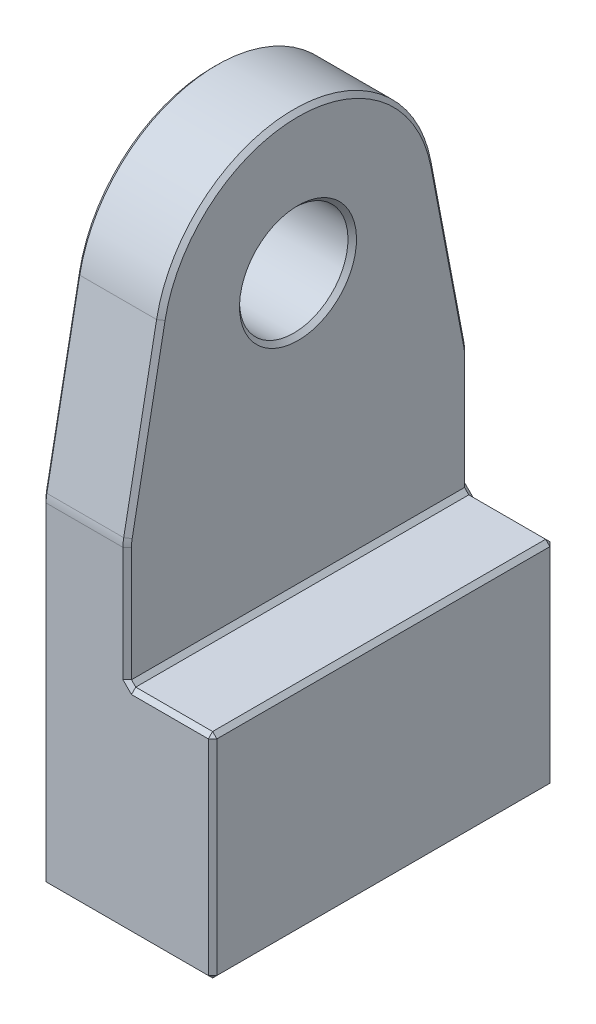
ISO-10303-21;
HEADER;
FILE_DESCRIPTION(('STEP AP214'),'2;1');
FILE_NAME('part.step','',(''),(''),'','','');
FILE_SCHEMA(('AUTOMOTIVE_DESIGN { 1 0 10303 214 1 1 1 1 }'));
ENDSEC;
DATA;
#1=APPLICATION_CONTEXT('core data for automotive mechanical design processes');
#2=APPLICATION_PROTOCOL_DEFINITION('international standard','automotive_design',2000,#1);
#3=PRODUCT_CONTEXT('',#1,'mechanical');
#4=PRODUCT('Part','Part','',(#3));
#5=PRODUCT_RELATED_PRODUCT_CATEGORY('part','',(#4));
#6=PRODUCT_DEFINITION_FORMATION('','',#4);
#7=PRODUCT_DEFINITION_CONTEXT('part definition',#1,'design');
#8=PRODUCT_DEFINITION('design','',#6,#7);
#9=PRODUCT_DEFINITION_SHAPE('','',#8);
#10=(LENGTH_UNIT() NAMED_UNIT(*) SI_UNIT(.MILLI.,.METRE.));
#11=(NAMED_UNIT(*) PLANE_ANGLE_UNIT() SI_UNIT($,.RADIAN.));
#12=(NAMED_UNIT(*) SI_UNIT($,.STERADIAN.) SOLID_ANGLE_UNIT());
#13=UNCERTAINTY_MEASURE_WITH_UNIT(LENGTH_MEASURE(1.E-05),#10,'distance_accuracy_value','');
#14=(GEOMETRIC_REPRESENTATION_CONTEXT(3) GLOBAL_UNCERTAINTY_ASSIGNED_CONTEXT((#13)) GLOBAL_UNIT_ASSIGNED_CONTEXT((#10,
#11,#12)) REPRESENTATION_CONTEXT('',''));
#15=CARTESIAN_POINT('',(0.,0.,0.));
#16=DIRECTION('',(0.,0.,1.));
#17=DIRECTION('',(1.,0.,0.));
#18=AXIS2_PLACEMENT_3D('',#15,#16,#17);
#19=CARTESIAN_POINT('',(20.,-18.0723794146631,-20.));
#20=DIRECTION('',(0.,0.,1.));
#21=DIRECTION('',(0.,-1.,0.));
#22=AXIS2_PLACEMENT_3D('',#19,#20,#21);
#23=PLANE('',#22);
#24=DIRECTION('',(-1.,0.,0.));
#25=VECTOR('',#24,1.);
#26=CARTESIAN_POINT('',(20.,-18.0723794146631,-20.));
#27=LINE('',#26,#25);
#28=CARTESIAN_POINT('',(9.50000000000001,-18.0723794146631,-20.));
#29=VERTEX_POINT('',#28);
#30=CARTESIAN_POINT('',(0.500000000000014,-18.0723794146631,-20.));
#31=VERTEX_POINT('',#30);
#32=EDGE_CURVE('E404',#29,#31,#27,.T.);
#33=ORIENTED_EDGE('',*,*,#32,.F.);
#34=DIRECTION('',(0.,-1.,0.));
#35=VECTOR('',#34,1.);
#36=CARTESIAN_POINT('',(9.50000000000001,-18.0723794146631,-20.));
#37=LINE('',#36,#35);
#38=CARTESIAN_POINT('',(9.50000000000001,-31.5,-20.));
#39=VERTEX_POINT('',#38);
#40=EDGE_CURVE('E248',#29,#39,#37,.T.);
#41=ORIENTED_EDGE('',*,*,#40,.T.);
#42=DIRECTION('',(-0.707106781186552,0.707106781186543,0.));
#43=VECTOR('',#42,1.);
#44=CARTESIAN_POINT('',(9.50000000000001,-31.5,-20.));
#45=LINE('',#44,#43);
#46=CARTESIAN_POINT('',(10.,-32.,-20.));
#47=VERTEX_POINT('',#46);
#48=EDGE_CURVE('E245',#47,#39,#45,.T.);
#49=ORIENTED_EDGE('',*,*,#48,.F.);
#50=DIRECTION('',(-0.707106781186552,0.707106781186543,0.));
#51=VECTOR('',#50,1.);
#52=CARTESIAN_POINT('',(9.50000000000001,-31.5,-20.));
#53=LINE('',#52,#51);
#54=CARTESIAN_POINT('',(10.5,-32.5,-20.));
#55=VERTEX_POINT('',#54);
#56=EDGE_CURVE('E242',#55,#47,#53,.T.);
#57=ORIENTED_EDGE('',*,*,#56,.F.);
#58=DIRECTION('',(1.,0.,0.));
#59=VECTOR('',#58,1.);
#60=CARTESIAN_POINT('',(20.,-32.5,-20.));
#61=LINE('',#60,#59);
#62=CARTESIAN_POINT('',(19.5,-32.5,-20.));
#63=VERTEX_POINT('',#62);
#64=EDGE_CURVE('E240',#55,#63,#61,.T.);
#65=ORIENTED_EDGE('',*,*,#64,.T.);
#66=DIRECTION('',(0.,-1.,0.));
#67=VECTOR('',#66,1.);
#68=CARTESIAN_POINT('',(19.5,-57.,-20.));
#69=LINE('',#68,#67);
#70=CARTESIAN_POINT('',(19.5,-56.5,-20.));
#71=VERTEX_POINT('',#70);
#72=EDGE_CURVE('E236',#63,#71,#69,.T.);
#73=ORIENTED_EDGE('',*,*,#72,.T.);
#74=DIRECTION('',(-1.,0.,0.));
#75=VECTOR('',#74,1.);
#76=CARTESIAN_POINT('',(20.,-56.5,-20.));
#77=LINE('',#76,#75);
#78=CARTESIAN_POINT('',(0.500000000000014,-56.5,-20.));
#79=VERTEX_POINT('',#78);
#80=EDGE_CURVE('E234',#71,#79,#77,.T.);
#81=ORIENTED_EDGE('',*,*,#80,.T.);
#82=DIRECTION('',(0.,1.,0.));
#83=VECTOR('',#82,1.);
#84=CARTESIAN_POINT('',(0.500000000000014,-18.0723794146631,-20.));
#85=LINE('',#84,#83);
#86=EDGE_CURVE('E238',#79,#31,#85,.T.);
#87=ORIENTED_EDGE('',*,*,#86,.T.);
#88=EDGE_LOOP('',(#33,#41,#49,#57,#65,#73,#81,#87));
#89=FACE_BOUND('',#88,.T.);
#90=ADVANCED_FACE('F31',(#89),#23,.F.);
#91=CARTESIAN_POINT('',(20.,-18.0723794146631,20.));
#92=DIRECTION('',(0.,0.,-1.));
#93=DIRECTION('',(0.,1.,0.));
#94=AXIS2_PLACEMENT_3D('',#91,#92,#93);
#95=PLANE('',#94);
#96=DIRECTION('',(0.707106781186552,-0.707106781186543,0.));
#97=VECTOR('',#96,1.);
#98=CARTESIAN_POINT('',(10.5,-32.5,20.));
#99=LINE('',#98,#97);
#100=CARTESIAN_POINT('',(9.50000000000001,-31.5,20.));
#101=VERTEX_POINT('',#100);
#102=CARTESIAN_POINT('',(10.,-32.,20.));
#103=VERTEX_POINT('',#102);
#104=EDGE_CURVE('E209',#101,#103,#99,.T.);
#105=ORIENTED_EDGE('',*,*,#104,.F.);
#106=DIRECTION('',(0.,1.,0.));
#107=VECTOR('',#106,1.);
#108=CARTESIAN_POINT('',(9.50000000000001,-18.0723794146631,20.));
#109=LINE('',#108,#107);
#110=CARTESIAN_POINT('',(9.50000000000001,-18.0723794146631,20.));
#111=VERTEX_POINT('',#110);
#112=EDGE_CURVE('E220',#101,#111,#109,.T.);
#113=ORIENTED_EDGE('',*,*,#112,.T.);
#114=DIRECTION('',(-1.,0.,0.));
#115=VECTOR('',#114,1.);
#116=CARTESIAN_POINT('',(20.,-18.0723794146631,20.));
#117=LINE('',#116,#115);
#118=CARTESIAN_POINT('',(0.500000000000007,-18.0723794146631,20.));
#119=VERTEX_POINT('',#118);
#120=EDGE_CURVE('E409',#111,#119,#117,.T.);
#121=ORIENTED_EDGE('',*,*,#120,.T.);
#122=DIRECTION('',(0.,-1.,0.));
#123=VECTOR('',#122,1.);
#124=CARTESIAN_POINT('',(0.500000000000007,-18.0723794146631,20.));
#125=LINE('',#124,#123);
#126=CARTESIAN_POINT('',(0.500000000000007,-56.5,20.));
#127=VERTEX_POINT('',#126);
#128=EDGE_CURVE('E458',#119,#127,#125,.T.);
#129=ORIENTED_EDGE('',*,*,#128,.T.);
#130=DIRECTION('',(1.,0.,0.));
#131=VECTOR('',#130,1.);
#132=CARTESIAN_POINT('',(20.,-56.5,20.));
#133=LINE('',#132,#131);
#134=CARTESIAN_POINT('',(19.5,-56.5,20.));
#135=VERTEX_POINT('',#134);
#136=EDGE_CURVE('E454',#127,#135,#133,.T.);
#137=ORIENTED_EDGE('',*,*,#136,.T.);
#138=DIRECTION('',(0.,1.,0.));
#139=VECTOR('',#138,1.);
#140=CARTESIAN_POINT('',(19.5,-32.,20.));
#141=LINE('',#140,#139);
#142=CARTESIAN_POINT('',(19.5,-32.5,20.));
#143=VERTEX_POINT('',#142);
#144=EDGE_CURVE('E456',#135,#143,#141,.T.);
#145=ORIENTED_EDGE('',*,*,#144,.T.);
#146=DIRECTION('',(-1.,0.,0.));
#147=VECTOR('',#146,1.);
#148=CARTESIAN_POINT('',(20.,-32.5,20.));
#149=LINE('',#148,#147);
#150=CARTESIAN_POINT('',(10.5,-32.5,20.));
#151=VERTEX_POINT('',#150);
#152=EDGE_CURVE('E212',#143,#151,#149,.T.);
#153=ORIENTED_EDGE('',*,*,#152,.T.);
#154=DIRECTION('',(0.707106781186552,-0.707106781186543,0.));
#155=VECTOR('',#154,1.);
#156=CARTESIAN_POINT('',(10.5,-32.5,20.));
#157=LINE('',#156,#155);
#158=EDGE_CURVE('E206',#103,#151,#157,.T.);
#159=ORIENTED_EDGE('',*,*,#158,.F.);
#160=EDGE_LOOP('',(#105,#113,#121,#129,#137,#145,#153,#159));
#161=FACE_BOUND('',#160,.T.);
#162=ADVANCED_FACE('F208',(#161),#95,.F.);
#163=CARTESIAN_POINT('',(20.,-18.0723794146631,-15.));
#164=DIRECTION('',(1.,0.,0.));
#165=DIRECTION('',(0.,0.,-1.));
#166=AXIS2_PLACEMENT_3D('',#163,#164,#165);
#167=PLANE('',#166);
#168=DIRECTION('',(0.,0.,-1.));
#169=VECTOR('',#168,1.);
#170=CARTESIAN_POINT('',(20.,-56.5,-20.));
#171=LINE('',#170,#169);
#172=CARTESIAN_POINT('',(20.,-56.5,19.5));
#173=VERTEX_POINT('',#172);
#174=CARTESIAN_POINT('',(20.,-56.5,-19.5));
#175=VERTEX_POINT('',#174);
#176=EDGE_CURVE('E40',#173,#175,#171,.T.);
#177=ORIENTED_EDGE('',*,*,#176,.T.);
#178=DIRECTION('',(0.,1.,0.));
#179=VECTOR('',#178,1.);
#180=CARTESIAN_POINT('',(20.,-32.,-19.5));
#181=LINE('',#180,#179);
#182=CARTESIAN_POINT('',(20.,-32.5,-19.5));
#183=VERTEX_POINT('',#182);
#184=EDGE_CURVE('E11',#175,#183,#181,.T.);
#185=ORIENTED_EDGE('',*,*,#184,.T.);
#186=DIRECTION('',(0.,0.,1.));
#187=VECTOR('',#186,1.);
#188=CARTESIAN_POINT('',(20.,-32.5,20.));
#189=LINE('',#188,#187);
#190=CARTESIAN_POINT('',(20.,-32.5,19.5));
#191=VERTEX_POINT('',#190);
#192=EDGE_CURVE('E54',#183,#191,#189,.T.);
#193=ORIENTED_EDGE('',*,*,#192,.T.);
#194=DIRECTION('',(0.,-1.,0.));
#195=VECTOR('',#194,1.);
#196=CARTESIAN_POINT('',(20.,-57.,19.5));
#197=LINE('',#196,#195);
#198=EDGE_CURVE('E299',#191,#173,#197,.T.);
#199=ORIENTED_EDGE('',*,*,#198,.T.);
#200=EDGE_LOOP('',(#177,#185,#193,#199));
#201=FACE_BOUND('',#200,.T.);
#202=ADVANCED_FACE('F599',(#201),#167,.T.);
#203=CARTESIAN_POINT('',(0.,-18.0723794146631,-15.));
#204=DIRECTION('',(1.,0.,0.));
#205=DIRECTION('',(0.,0.,-1.));
#206=AXIS2_PLACEMENT_3D('',#203,#204,#205);
#207=PLANE('',#206);
#208=CARTESIAN_POINT('',(0.,0.,0.));
#209=DIRECTION('',(1.,0.,0.));
#210=DIRECTION('',(0.,0.,-1.));
#211=AXIS2_PLACEMENT_3D('',#208,#209,#210);
#212=CIRCLE('',#211,6.85);
#213=CARTESIAN_POINT('',(0.,0.,-6.85));
#214=VERTEX_POINT('',#213);
#215=EDGE_CURVE('E445',#214,#214,#212,.T.);
#216=ORIENTED_EDGE('',*,*,#215,.T.);
#217=EDGE_LOOP('',(#216));
#218=FACE_BOUND('',#217,.T.);
#219=CARTESIAN_POINT('',(0.,0.,0.));
#220=DIRECTION('',(1.,0.,0.));
#221=DIRECTION('',(0.,0.,-1.));
#222=AXIS2_PLACEMENT_3D('',#219,#220,#221);
#223=CIRCLE('',#222,15.85);
#224=CARTESIAN_POINT('',(0.,2.9683905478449,15.5695586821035));
#225=VERTEX_POINT('',#224);
#226=CARTESIAN_POINT('',(0.,2.96839054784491,-15.5695586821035));
#227=VERTEX_POINT('',#226);
#228=EDGE_CURVE('E440',#225,#227,#223,.F.);
#229=ORIENTED_EDGE('',*,*,#228,.T.);
#230=DIRECTION('',(0.,-0.982306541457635,-0.187280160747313));
#231=VECTOR('',#230,1.);
#232=CARTESIAN_POINT('',(0.,-17.2296186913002,-19.4203794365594));
#233=LINE('',#232,#231);
#234=CARTESIAN_POINT('',(0.,-17.2296186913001,-19.4203794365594));
#235=VERTEX_POINT('',#234);
#236=EDGE_CURVE('E442',#227,#235,#233,.T.);
#237=ORIENTED_EDGE('',*,*,#236,.T.);
#238=CARTESIAN_POINT('',(0.,-18.0723794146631,-15.));
#239=DIRECTION('',(1.,0.,0.));
#240=DIRECTION('',(0.,0.,-1.));
#241=AXIS2_PLACEMENT_3D('',#238,#239,#240);
#242=CIRCLE('',#241,4.49999999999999);
#243=CARTESIAN_POINT('',(0.,-18.0723794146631,-19.5));
#244=VERTEX_POINT('',#243);
#245=EDGE_CURVE('E430',#235,#244,#242,.F.);
#246=ORIENTED_EDGE('',*,*,#245,.T.);
#247=DIRECTION('',(0.,-1.,0.));
#248=VECTOR('',#247,1.);
#249=CARTESIAN_POINT('',(0.,-18.0723794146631,-19.5));
#250=LINE('',#249,#248);
#251=CARTESIAN_POINT('',(0.,-56.5,-19.5));
#252=VERTEX_POINT('',#251);
#253=EDGE_CURVE('E428',#244,#252,#250,.T.);
#254=ORIENTED_EDGE('',*,*,#253,.T.);
#255=DIRECTION('',(0.,0.,1.));
#256=VECTOR('',#255,1.);
#257=CARTESIAN_POINT('',(0.,-56.5,-15.));
#258=LINE('',#257,#256);
#259=CARTESIAN_POINT('',(0.,-56.5,19.5));
#260=VERTEX_POINT('',#259);
#261=EDGE_CURVE('E432',#252,#260,#258,.T.);
#262=ORIENTED_EDGE('',*,*,#261,.T.);
#263=DIRECTION('',(0.,1.,0.));
#264=VECTOR('',#263,1.);
#265=CARTESIAN_POINT('',(0.,-18.0723794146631,19.5));
#266=LINE('',#265,#264);
#267=CARTESIAN_POINT('',(0.,-18.0723794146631,19.5));
#268=VERTEX_POINT('',#267);
#269=EDGE_CURVE('E434',#260,#268,#266,.T.);
#270=ORIENTED_EDGE('',*,*,#269,.T.);
#271=CARTESIAN_POINT('',(0.,-18.0723794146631,15.));
#272=DIRECTION('',(1.,0.,0.));
#273=DIRECTION('',(0.,0.,-1.));
#274=AXIS2_PLACEMENT_3D('',#271,#272,#273);
#275=CIRCLE('',#274,4.49999999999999);
#276=CARTESIAN_POINT('',(0.,-17.2296186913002,19.4203794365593));
#277=VERTEX_POINT('',#276);
#278=EDGE_CURVE('E436',#268,#277,#275,.F.);
#279=ORIENTED_EDGE('',*,*,#278,.T.);
#280=DIRECTION('',(0.,0.982306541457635,-0.187280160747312));
#281=VECTOR('',#280,1.);
#282=CARTESIAN_POINT('',(0.,-11.7106228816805,18.3681636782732));
#283=LINE('',#282,#281);
#284=EDGE_CURVE('E438',#277,#225,#283,.T.);
#285=ORIENTED_EDGE('',*,*,#284,.T.);
#286=EDGE_LOOP('',(#229,#237,#246,#254,#262,#270,#279,#285));
#287=FACE_BOUND('',#286,.T.);
#288=ADVANCED_FACE('F572',(#218,#287),#207,.F.);
#289=CARTESIAN_POINT('',(20.,-18.0723794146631,-15.));
#290=DIRECTION('',(-1.,0.,0.));
#291=DIRECTION('',(0.,0.,1.));
#292=AXIS2_PLACEMENT_3D('',#289,#290,#291);
#293=CYLINDRICAL_SURFACE('',#292,5.);
#294=DIRECTION('',(-1.,0.,0.));
#295=VECTOR('',#294,1.);
#296=CARTESIAN_POINT('',(20.,-17.1359786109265,-19.9115327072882));
#297=LINE('',#296,#295);
#298=CARTESIAN_POINT('',(9.50000000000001,-17.1359786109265,-19.9115327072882));
#299=VERTEX_POINT('',#298);
#300=CARTESIAN_POINT('',(0.500000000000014,-17.1359786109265,-19.9115327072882));
#301=VERTEX_POINT('',#300);
#302=EDGE_CURVE('E425',#299,#301,#297,.T.);
#303=ORIENTED_EDGE('',*,*,#302,.F.);
#304=CARTESIAN_POINT('',(9.50000000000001,-18.0723794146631,-15.));
#305=DIRECTION('',(-1.,0.,0.));
#306=DIRECTION('',(0.,0.,1.));
#307=AXIS2_PLACEMENT_3D('',#304,#305,#306);
#308=CIRCLE('',#307,5.);
#309=EDGE_CURVE('E288',#299,#29,#308,.T.);
#310=ORIENTED_EDGE('',*,*,#309,.T.);
#311=ORIENTED_EDGE('',*,*,#32,.T.);
#312=CARTESIAN_POINT('',(0.500000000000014,-18.0723794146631,-15.));
#313=DIRECTION('',(1.,0.,0.));
#314=DIRECTION('',(0.,0.,-1.));
#315=AXIS2_PLACEMENT_3D('',#312,#313,#314);
#316=CIRCLE('',#315,5.);
#317=EDGE_CURVE('E286',#31,#301,#316,.T.);
#318=ORIENTED_EDGE('',*,*,#317,.T.);
#319=EDGE_LOOP('',(#303,#310,#311,#318));
#320=FACE_BOUND('',#319,.T.);
#321=ADVANCED_FACE('F546',(#320),#293,.T.);
#322=CARTESIAN_POINT('',(20.,-17.1359786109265,-19.9115327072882));
#323=DIRECTION('',(0.,-0.187280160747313,0.982306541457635));
#324=DIRECTION('',(0.,-0.982306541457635,-0.187280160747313));
#325=AXIS2_PLACEMENT_3D('',#322,#323,#324);
#326=PLANE('',#325);
#327=DIRECTION('',(-1.,0.,0.));
#328=VECTOR('',#327,1.);
#329=CARTESIAN_POINT('',(20.,3.06203062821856,-16.0607119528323));
#330=LINE('',#329,#328);
#331=CARTESIAN_POINT('',(9.50000000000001,3.06203062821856,-16.0607119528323));
#332=VERTEX_POINT('',#331);
#333=CARTESIAN_POINT('',(0.500000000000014,3.06203062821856,-16.0607119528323));
#334=VERTEX_POINT('',#333);
#335=EDGE_CURVE('E422',#332,#334,#330,.T.);
#336=ORIENTED_EDGE('',*,*,#335,.F.);
#337=DIRECTION('',(0.,-0.982306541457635,-0.187280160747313));
#338=VECTOR('',#337,1.);
#339=CARTESIAN_POINT('',(9.50000000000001,-17.1359786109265,-19.9115327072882));
#340=LINE('',#339,#338);
#341=EDGE_CURVE('E284',#332,#299,#340,.T.);
#342=ORIENTED_EDGE('',*,*,#341,.T.);
#343=ORIENTED_EDGE('',*,*,#302,.T.);
#344=DIRECTION('',(0.,0.982306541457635,0.187280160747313));
#345=VECTOR('',#344,1.);
#346=CARTESIAN_POINT('',(0.500000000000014,-17.1359786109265,-19.9115327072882));
#347=LINE('',#346,#345);
#348=EDGE_CURVE('E282',#301,#334,#347,.T.);
#349=ORIENTED_EDGE('',*,*,#348,.T.);
#350=EDGE_LOOP('',(#336,#342,#343,#349));
#351=FACE_BOUND('',#350,.T.);
#352=ADVANCED_FACE('F533',(#351),#326,.F.);
#353=CARTESIAN_POINT('',(20.,0.,0.));
#354=DIRECTION('',(-1.,0.,0.));
#355=DIRECTION('',(0.,0.,1.));
#356=AXIS2_PLACEMENT_3D('',#353,#354,#355);
#357=CYLINDRICAL_SURFACE('',#356,16.35);
#358=DIRECTION('',(-1.,0.,0.));
#359=VECTOR('',#358,1.);
#360=CARTESIAN_POINT('',(20.,3.06203062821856,16.0607119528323));
#361=LINE('',#360,#359);
#362=CARTESIAN_POINT('',(9.50000000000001,3.06203062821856,16.0607119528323));
#363=VERTEX_POINT('',#362);
#364=CARTESIAN_POINT('',(0.500000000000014,3.06203062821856,16.0607119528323));
#365=VERTEX_POINT('',#364);
#366=EDGE_CURVE('E419',#363,#365,#361,.T.);
#367=ORIENTED_EDGE('',*,*,#366,.F.);
#368=CARTESIAN_POINT('',(9.50000000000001,0.,0.));
#369=DIRECTION('',(-1.,0.,0.));
#370=DIRECTION('',(0.,0.,1.));
#371=AXIS2_PLACEMENT_3D('',#368,#369,#370);
#372=CIRCLE('',#371,16.35);
#373=EDGE_CURVE('E280',#363,#332,#372,.T.);
#374=ORIENTED_EDGE('',*,*,#373,.T.);
#375=ORIENTED_EDGE('',*,*,#335,.T.);
#376=CARTESIAN_POINT('',(0.500000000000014,0.,0.));
#377=DIRECTION('',(1.,0.,0.));
#378=DIRECTION('',(0.,0.,-1.));
#379=AXIS2_PLACEMENT_3D('',#376,#377,#378);
#380=CIRCLE('',#379,16.35);
#381=EDGE_CURVE('E278',#334,#365,#380,.T.);
#382=ORIENTED_EDGE('',*,*,#381,.T.);
#383=EDGE_LOOP('',(#367,#374,#375,#382));
#384=FACE_BOUND('',#383,.T.);
#385=ADVANCED_FACE('F530',(#384),#357,.T.);
#386=CARTESIAN_POINT('',(20.,-17.1359786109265,19.9115327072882));
#387=DIRECTION('',(0.,-0.187280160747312,-0.982306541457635));
#388=DIRECTION('',(0.,0.982306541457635,-0.187280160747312));
#389=AXIS2_PLACEMENT_3D('',#386,#387,#388);
#390=PLANE('',#389);
#391=DIRECTION('',(-1.,0.,0.));
#392=VECTOR('',#391,1.);
#393=CARTESIAN_POINT('',(20.,-17.1359786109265,19.9115327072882));
#394=LINE('',#393,#392);
#395=CARTESIAN_POINT('',(9.50000000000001,-17.1359786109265,19.9115327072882));
#396=VERTEX_POINT('',#395);
#397=CARTESIAN_POINT('',(0.500000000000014,-17.1359786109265,19.9115327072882));
#398=VERTEX_POINT('',#397);
#399=EDGE_CURVE('E414',#396,#398,#394,.T.);
#400=ORIENTED_EDGE('',*,*,#399,.F.);
#401=DIRECTION('',(0.,0.982306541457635,-0.187280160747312));
#402=VECTOR('',#401,1.);
#403=CARTESIAN_POINT('',(9.50000000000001,-17.1359786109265,19.9115327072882));
#404=LINE('',#403,#402);
#405=EDGE_CURVE('E276',#396,#363,#404,.T.);
#406=ORIENTED_EDGE('',*,*,#405,.T.);
#407=ORIENTED_EDGE('',*,*,#366,.T.);
#408=DIRECTION('',(0.,-0.982306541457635,0.187280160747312));
#409=VECTOR('',#408,1.);
#410=CARTESIAN_POINT('',(0.500000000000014,-17.1359786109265,19.9115327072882));
#411=LINE('',#410,#409);
#412=EDGE_CURVE('E274',#365,#398,#411,.T.);
#413=ORIENTED_EDGE('',*,*,#412,.T.);
#414=EDGE_LOOP('',(#400,#406,#407,#413));
#415=FACE_BOUND('',#414,.T.);
#416=ADVANCED_FACE('F517',(#415),#390,.F.);
#417=CARTESIAN_POINT('',(20.,-18.0723794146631,15.));
#418=DIRECTION('',(-1.,0.,0.));
#419=DIRECTION('',(0.,0.,1.));
#420=AXIS2_PLACEMENT_3D('',#417,#418,#419);
#421=CYLINDRICAL_SURFACE('',#420,5.);
#422=ORIENTED_EDGE('',*,*,#120,.F.);
#423=CARTESIAN_POINT('',(9.50000000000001,-18.0723794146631,15.));
#424=DIRECTION('',(-1.,0.,0.));
#425=DIRECTION('',(0.,0.,1.));
#426=AXIS2_PLACEMENT_3D('',#423,#424,#425);
#427=CIRCLE('',#426,5.);
#428=EDGE_CURVE('E272',#111,#396,#427,.T.);
#429=ORIENTED_EDGE('',*,*,#428,.T.);
#430=ORIENTED_EDGE('',*,*,#399,.T.);
#431=CARTESIAN_POINT('',(0.500000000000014,-18.0723794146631,15.));
#432=DIRECTION('',(1.,0.,0.));
#433=DIRECTION('',(0.,0.,-1.));
#434=AXIS2_PLACEMENT_3D('',#431,#432,#433);
#435=CIRCLE('',#434,5.);
#436=EDGE_CURVE('E270',#398,#119,#435,.T.);
#437=ORIENTED_EDGE('',*,*,#436,.T.);
#438=EDGE_LOOP('',(#422,#429,#430,#437));
#439=FACE_BOUND('',#438,.T.);
#440=ADVANCED_FACE('F513',(#439),#421,.T.);
#441=CARTESIAN_POINT('',(20.,-57.,20.));
#442=DIRECTION('',(0.,1.,0.));
#443=DIRECTION('',(0.,0.,1.));
#444=AXIS2_PLACEMENT_3D('',#441,#442,#443);
#445=PLANE('',#444);
#446=DIRECTION('',(-1.,0.,0.));
#447=VECTOR('',#446,1.);
#448=CARTESIAN_POINT('',(20.,-57.,19.5));
#449=LINE('',#448,#447);
#450=CARTESIAN_POINT('',(19.5,-57.,19.5));
#451=VERTEX_POINT('',#450);
#452=CARTESIAN_POINT('',(0.500000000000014,-57.,19.5));
#453=VERTEX_POINT('',#452);
#454=EDGE_CURVE('E290',#451,#453,#449,.T.);
#455=ORIENTED_EDGE('',*,*,#454,.T.);
#456=DIRECTION('',(0.,0.,-1.));
#457=VECTOR('',#456,1.);
#458=CARTESIAN_POINT('',(0.500000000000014,-57.,20.));
#459=LINE('',#458,#457);
#460=CARTESIAN_POINT('',(0.500000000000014,-57.,-19.5));
#461=VERTEX_POINT('',#460);
#462=EDGE_CURVE('E296',#453,#461,#459,.T.);
#463=ORIENTED_EDGE('',*,*,#462,.T.);
#464=DIRECTION('',(1.,0.,0.));
#465=VECTOR('',#464,1.);
#466=CARTESIAN_POINT('',(20.,-57.,-19.5));
#467=LINE('',#466,#465);
#468=CARTESIAN_POINT('',(19.5,-57.,-19.5));
#469=VERTEX_POINT('',#468);
#470=EDGE_CURVE('E294',#461,#469,#467,.T.);
#471=ORIENTED_EDGE('',*,*,#470,.T.);
#472=DIRECTION('',(0.,0.,1.));
#473=VECTOR('',#472,1.);
#474=CARTESIAN_POINT('',(19.5,-57.,20.));
#475=LINE('',#474,#473);
#476=EDGE_CURVE('E292',#469,#451,#475,.T.);
#477=ORIENTED_EDGE('',*,*,#476,.T.);
#478=EDGE_LOOP('',(#455,#463,#471,#477));
#479=FACE_BOUND('',#478,.T.);
#480=ADVANCED_FACE('F566',(#479),#445,.F.);
#481=CARTESIAN_POINT('',(20.,0.,0.));
#482=DIRECTION('',(-1.,0.,0.));
#483=DIRECTION('',(0.,0.,1.));
#484=AXIS2_PLACEMENT_3D('',#481,#482,#483);
#485=CYLINDRICAL_SURFACE('',#484,6.35);
#486=CARTESIAN_POINT('',(0.500000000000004,0.,0.));
#487=DIRECTION('',(1.,0.,0.));
#488=DIRECTION('',(0.,0.,-1.));
#489=AXIS2_PLACEMENT_3D('',#486,#487,#488);
#490=CIRCLE('',#489,6.35);
#491=CARTESIAN_POINT('',(0.500000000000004,0.,-6.35));
#492=VERTEX_POINT('',#491);
#493=EDGE_CURVE('E451',#492,#492,#490,.F.);
#494=ORIENTED_EDGE('',*,*,#493,.T.);
#495=EDGE_LOOP('',(#494));
#496=FACE_BOUND('',#495,.T.);
#497=CARTESIAN_POINT('',(9.5,0.,0.));
#498=DIRECTION('',(-1.,0.,0.));
#499=DIRECTION('',(0.,0.,1.));
#500=AXIS2_PLACEMENT_3D('',#497,#498,#499);
#501=CIRCLE('',#500,6.35);
#502=CARTESIAN_POINT('',(9.5,0.,6.35));
#503=VERTEX_POINT('',#502);
#504=EDGE_CURVE('E448',#503,#503,#501,.F.);
#505=ORIENTED_EDGE('',*,*,#504,.T.);
#506=EDGE_LOOP('',(#505));
#507=FACE_BOUND('',#506,.T.);
#508=ADVANCED_FACE('F605',(#496,#507),#485,.F.);
#509=CARTESIAN_POINT('',(20.,-32.,-24.8));
#510=DIRECTION('',(0.,-1.,0.));
#511=DIRECTION('',(0.,0.,-1.));
#512=AXIS2_PLACEMENT_3D('',#509,#510,#511);
#513=PLANE('',#512);
#514=DIRECTION('',(-1.,0.,0.));
#515=VECTOR('',#514,1.);
#516=CARTESIAN_POINT('',(20.,-32.,-19.5));
#517=LINE('',#516,#515);
#518=CARTESIAN_POINT('',(19.5,-32.,-19.5));
#519=VERTEX_POINT('',#518);
#520=CARTESIAN_POINT('',(10.5,-32.,-19.5));
#521=VERTEX_POINT('',#520);
#522=EDGE_CURVE('E227',#519,#521,#517,.T.);
#523=ORIENTED_EDGE('',*,*,#522,.T.);
#524=DIRECTION('',(0.,0.,1.));
#525=VECTOR('',#524,1.);
#526=CARTESIAN_POINT('',(10.5,-32.,20.));
#527=LINE('',#526,#525);
#528=CARTESIAN_POINT('',(10.5,-32.,19.5));
#529=VERTEX_POINT('',#528);
#530=EDGE_CURVE('E232',#521,#529,#527,.T.);
#531=ORIENTED_EDGE('',*,*,#530,.T.);
#532=DIRECTION('',(1.,0.,0.));
#533=VECTOR('',#532,1.);
#534=CARTESIAN_POINT('',(20.,-32.,19.5));
#535=LINE('',#534,#533);
#536=CARTESIAN_POINT('',(19.5,-32.,19.5));
#537=VERTEX_POINT('',#536);
#538=EDGE_CURVE('E229',#529,#537,#535,.T.);
#539=ORIENTED_EDGE('',*,*,#538,.T.);
#540=DIRECTION('',(0.,0.,-1.));
#541=VECTOR('',#540,1.);
#542=CARTESIAN_POINT('',(19.5,-32.,-20.));
#543=LINE('',#542,#541);
#544=EDGE_CURVE('E222',#537,#519,#543,.T.);
#545=ORIENTED_EDGE('',*,*,#544,.T.);
#546=EDGE_LOOP('',(#523,#531,#539,#545));
#547=FACE_BOUND('',#546,.T.);
#548=ADVANCED_FACE('F905',(#547),#513,.F.);
#549=CARTESIAN_POINT('',(10.,16.35,-24.8));
#550=DIRECTION('',(-1.,0.,0.));
#551=DIRECTION('',(0.,-1.,0.));
#552=AXIS2_PLACEMENT_3D('',#549,#550,#551);
#553=PLANE('',#552);
#554=CARTESIAN_POINT('',(10.,-18.0723794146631,15.));
#555=DIRECTION('',(-1.,0.,0.));
#556=DIRECTION('',(0.,-1.,0.));
#557=AXIS2_PLACEMENT_3D('',#554,#555,#556);
#558=CIRCLE('',#557,4.50000000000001);
#559=CARTESIAN_POINT('',(10.,-17.2296186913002,19.4203794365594));
#560=VERTEX_POINT('',#559);
#561=CARTESIAN_POINT('',(10.,-18.0723794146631,19.5));
#562=VERTEX_POINT('',#561);
#563=EDGE_CURVE('E265',#560,#562,#558,.F.);
#564=ORIENTED_EDGE('',*,*,#563,.T.);
#565=DIRECTION('',(0.,-1.,0.));
#566=VECTOR('',#565,1.);
#567=CARTESIAN_POINT('',(10.,16.35,19.5));
#568=LINE('',#567,#566);
#569=CARTESIAN_POINT('',(10.,-31.5,19.5));
#570=VERTEX_POINT('',#569);
#571=EDGE_CURVE('E267',#562,#570,#568,.T.);
#572=ORIENTED_EDGE('',*,*,#571,.T.);
#573=DIRECTION('',(0.,0.,-1.));
#574=VECTOR('',#573,1.);
#575=CARTESIAN_POINT('',(10.,-31.5,-20.));
#576=LINE('',#575,#574);
#577=CARTESIAN_POINT('',(10.,-31.5,-19.5));
#578=VERTEX_POINT('',#577);
#579=EDGE_CURVE('E253',#570,#578,#576,.T.);
#580=ORIENTED_EDGE('',*,*,#579,.T.);
#581=DIRECTION('',(0.,1.,0.));
#582=VECTOR('',#581,1.);
#583=CARTESIAN_POINT('',(10.,16.35,-19.5));
#584=LINE('',#583,#582);
#585=CARTESIAN_POINT('',(10.,-18.0723794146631,-19.5));
#586=VERTEX_POINT('',#585);
#587=EDGE_CURVE('E255',#578,#586,#584,.T.);
#588=ORIENTED_EDGE('',*,*,#587,.T.);
#589=CARTESIAN_POINT('',(10.,-18.0723794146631,-15.));
#590=DIRECTION('',(-1.,0.,0.));
#591=DIRECTION('',(0.,-1.,0.));
#592=AXIS2_PLACEMENT_3D('',#589,#590,#591);
#593=CIRCLE('',#592,4.50000000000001);
#594=CARTESIAN_POINT('',(10.,-17.2296186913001,-19.4203794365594));
#595=VERTEX_POINT('',#594);
#596=EDGE_CURVE('E257',#586,#595,#593,.F.);
#597=ORIENTED_EDGE('',*,*,#596,.T.);
#598=DIRECTION('',(0.,0.982306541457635,0.187280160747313));
#599=VECTOR('',#598,1.);
#600=CARTESIAN_POINT('',(10.,14.1825630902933,-13.4315376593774));
#601=LINE('',#600,#599);
#602=CARTESIAN_POINT('',(10.,2.96839054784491,-15.5695586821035));
#603=VERTEX_POINT('',#602);
#604=EDGE_CURVE('E259',#595,#603,#601,.T.);
#605=ORIENTED_EDGE('',*,*,#604,.T.);
#606=CARTESIAN_POINT('',(10.,0.,0.));
#607=DIRECTION('',(-1.,0.,0.));
#608=DIRECTION('',(0.,-1.,0.));
#609=AXIS2_PLACEMENT_3D('',#606,#607,#608);
#610=CIRCLE('',#609,15.85);
#611=CARTESIAN_POINT('',(10.,2.96839054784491,15.5695586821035));
#612=VERTEX_POINT('',#611);
#613=EDGE_CURVE('E261',#603,#612,#610,.F.);
#614=ORIENTED_EDGE('',*,*,#613,.T.);
#615=DIRECTION('',(0.,-0.982306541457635,0.187280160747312));
#616=VECTOR('',#615,1.);
#617=CARTESIAN_POINT('',(10.,23.3073028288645,11.6918742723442));
#618=LINE('',#617,#616);
#619=EDGE_CURVE('E263',#612,#560,#618,.T.);
#620=ORIENTED_EDGE('',*,*,#619,.T.);
#621=EDGE_LOOP('',(#564,#572,#580,#588,#597,#605,#614,#620));
#622=FACE_BOUND('',#621,.T.);
#623=CARTESIAN_POINT('',(10.,0.,0.));
#624=DIRECTION('',(-1.,0.,0.));
#625=DIRECTION('',(0.,-1.,0.));
#626=AXIS2_PLACEMENT_3D('',#623,#624,#625);
#627=CIRCLE('',#626,6.85);
#628=CARTESIAN_POINT('',(10.,-6.85,0.));
#629=VERTEX_POINT('',#628);
#630=EDGE_CURVE('E250',#629,#629,#627,.T.);
#631=ORIENTED_EDGE('',*,*,#630,.T.);
#632=EDGE_LOOP('',(#631));
#633=FACE_BOUND('',#632,.T.);
#634=ADVANCED_FACE('F502',(#622,#633),#553,.F.);
#635=CARTESIAN_POINT('',(0.,0.,0.));
#636=DIRECTION('',(-1.,0.,0.));
#637=DIRECTION('',(0.,0.,1.));
#638=AXIS2_PLACEMENT_3D('',#635,#636,#637);
#639=CONICAL_SURFACE('',#638,6.85,0.785398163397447);
#640=ORIENTED_EDGE('',*,*,#493,.F.);
#641=EDGE_LOOP('',(#640));
#642=FACE_BOUND('',#641,.T.);
#643=ORIENTED_EDGE('',*,*,#215,.F.);
#644=EDGE_LOOP('',(#643));
#645=FACE_BOUND('',#644,.T.);
#646=ADVANCED_FACE('F617',(#642,#645),#639,.F.);
#647=CARTESIAN_POINT('',(0.500000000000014,-17.1359786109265,-19.9115327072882));
#648=DIRECTION('',(0.707106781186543,-0.132427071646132,0.694595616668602));
#649=DIRECTION('',(0.700767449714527,0.,-0.713389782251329));
#650=AXIS2_PLACEMENT_3D('',#647,#648,#649);
#651=PLANE('',#650);
#652=DIRECTION('',(-0.707106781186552,-0.132427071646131,0.694595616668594));
#653=VECTOR('',#652,1.);
#654=CARTESIAN_POINT('',(0.500000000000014,3.06203062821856,-16.0607119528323));
#655=LINE('',#654,#653);
#656=EDGE_CURVE('E397',#334,#227,#655,.T.);
#657=ORIENTED_EDGE('',*,*,#656,.F.);
#658=ORIENTED_EDGE('',*,*,#348,.F.);
#659=DIRECTION('',(0.707106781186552,0.132427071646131,-0.694595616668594));
#660=VECTOR('',#659,1.);
#661=CARTESIAN_POINT('',(0.,-17.2296186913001,-19.4203794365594));
#662=LINE('',#661,#660);
#663=EDGE_CURVE('E35',#235,#301,#662,.T.);
#664=ORIENTED_EDGE('',*,*,#663,.F.);
#665=ORIENTED_EDGE('',*,*,#236,.F.);
#666=EDGE_LOOP('',(#657,#658,#664,#665));
#667=FACE_BOUND('',#666,.T.);
#668=ADVANCED_FACE('F577',(#667),#651,.F.);
#669=CARTESIAN_POINT('',(0.500000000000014,-18.0723794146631,-15.));
#670=DIRECTION('',(1.,0.,0.));
#671=DIRECTION('',(0.,0.,-1.));
#672=AXIS2_PLACEMENT_3D('',#669,#670,#671);
#673=CONICAL_SURFACE('',#672,5.,0.785398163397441);
#674=ORIENTED_EDGE('',*,*,#663,.T.);
#675=ORIENTED_EDGE('',*,*,#317,.F.);
#676=DIRECTION('',(0.707106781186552,0.,-0.707106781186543));
#677=VECTOR('',#676,1.);
#678=CARTESIAN_POINT('',(0.,-18.0723794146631,-19.5));
#679=LINE('',#678,#677);
#680=EDGE_CURVE('E395',#244,#31,#679,.T.);
#681=ORIENTED_EDGE('',*,*,#680,.F.);
#682=ORIENTED_EDGE('',*,*,#245,.F.);
#683=EDGE_LOOP('',(#674,#675,#681,#682));
#684=FACE_BOUND('',#683,.T.);
#685=ADVANCED_FACE('F575',(#684),#673,.T.);
#686=CARTESIAN_POINT('',(0.500000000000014,0.,0.));
#687=DIRECTION('',(1.,0.,0.));
#688=DIRECTION('',(0.,0.,-1.));
#689=AXIS2_PLACEMENT_3D('',#686,#687,#688);
#690=CONICAL_SURFACE('',#689,16.35,0.785398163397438);
#691=ORIENTED_EDGE('',*,*,#656,.T.);
#692=ORIENTED_EDGE('',*,*,#228,.F.);
#693=DIRECTION('',(-0.707106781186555,-0.13242707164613,-0.69459561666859));
#694=VECTOR('',#693,1.);
#695=CARTESIAN_POINT('',(0.500000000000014,3.06203062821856,16.0607119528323));
#696=LINE('',#695,#694);
#697=EDGE_CURVE('E392',#365,#225,#696,.T.);
#698=ORIENTED_EDGE('',*,*,#697,.F.);
#699=ORIENTED_EDGE('',*,*,#381,.F.);
#700=EDGE_LOOP('',(#691,#692,#698,#699));
#701=FACE_BOUND('',#700,.T.);
#702=ADVANCED_FACE('F579',(#701),#690,.T.);
#703=CARTESIAN_POINT('',(0.500000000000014,-18.0723794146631,-20.));
#704=DIRECTION('',(0.707106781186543,0.,0.707106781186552));
#705=DIRECTION('',(0.707106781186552,0.,-0.707106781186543));
#706=AXIS2_PLACEMENT_3D('',#703,#704,#705);
#707=PLANE('',#706);
#708=ORIENTED_EDGE('',*,*,#680,.T.);
#709=ORIENTED_EDGE('',*,*,#86,.F.);
#710=DIRECTION('',(-0.707106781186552,0.,0.707106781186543));
#711=VECTOR('',#710,1.);
#712=CARTESIAN_POINT('',(0.250000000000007,-56.5,-19.75));
#713=LINE('',#712,#711);
#714=EDGE_CURVE('E389',#252,#79,#713,.F.);
#715=ORIENTED_EDGE('',*,*,#714,.F.);
#716=ORIENTED_EDGE('',*,*,#253,.F.);
#717=EDGE_LOOP('',(#708,#709,#715,#716));
#718=FACE_BOUND('',#717,.T.);
#719=ADVANCED_FACE('F553',(#718),#707,.F.);
#720=CARTESIAN_POINT('',(0.500000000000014,-17.1359786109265,19.9115327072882));
#721=DIRECTION('',(0.707106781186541,-0.132427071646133,-0.694595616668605));
#722=DIRECTION('',(-0.700767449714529,0.,-0.713389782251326));
#723=AXIS2_PLACEMENT_3D('',#720,#721,#722);
#724=PLANE('',#723);
#725=ORIENTED_EDGE('',*,*,#697,.T.);
#726=ORIENTED_EDGE('',*,*,#284,.F.);
#727=DIRECTION('',(-0.707106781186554,-0.132427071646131,-0.694595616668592));
#728=VECTOR('',#727,1.);
#729=CARTESIAN_POINT('',(0.500000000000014,-17.1359786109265,19.9115327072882));
#730=LINE('',#729,#728);
#731=EDGE_CURVE('E386',#398,#277,#730,.T.);
#732=ORIENTED_EDGE('',*,*,#731,.F.);
#733=ORIENTED_EDGE('',*,*,#412,.F.);
#734=EDGE_LOOP('',(#725,#726,#732,#733));
#735=FACE_BOUND('',#734,.T.);
#736=ADVANCED_FACE('F582',(#735),#724,.F.);
#737=CARTESIAN_POINT('',(0.500000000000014,-57.,-19.5));
#738=DIRECTION('',(-0.577350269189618,-0.577350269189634,-0.577350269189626));
#739=DIRECTION('',(0.,0.707106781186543,-0.707106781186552));
#740=AXIS2_PLACEMENT_3D('',#737,#738,#739);
#741=PLANE('',#740);
#742=DIRECTION('',(0.707106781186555,-0.70710678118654,0.));
#743=VECTOR('',#742,1.);
#744=CARTESIAN_POINT('',(0.500000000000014,-57.,-19.5));
#745=LINE('',#744,#743);
#746=EDGE_CURVE('E380',#252,#461,#745,.T.);
#747=ORIENTED_EDGE('',*,*,#746,.F.);
#748=ORIENTED_EDGE('',*,*,#714,.T.);
#749=DIRECTION('',(0.,0.707106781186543,-0.707106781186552));
#750=VECTOR('',#749,1.);
#751=CARTESIAN_POINT('',(0.500000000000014,-57.,-19.5));
#752=LINE('',#751,#750);
#753=EDGE_CURVE('E383',#461,#79,#752,.T.);
#754=ORIENTED_EDGE('',*,*,#753,.F.);
#755=EDGE_LOOP('',(#747,#748,#754));
#756=FACE_BOUND('',#755,.T.);
#757=ADVANCED_FACE('F559',(#756),#741,.T.);
#758=CARTESIAN_POINT('',(0.500000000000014,-18.0723794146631,15.));
#759=DIRECTION('',(1.,0.,0.));
#760=DIRECTION('',(0.,0.,-1.));
#761=AXIS2_PLACEMENT_3D('',#758,#759,#760);
#762=CONICAL_SURFACE('',#761,5.,0.785398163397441);
#763=ORIENTED_EDGE('',*,*,#731,.T.);
#764=ORIENTED_EDGE('',*,*,#278,.F.);
#765=DIRECTION('',(-0.707106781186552,0.,-0.707106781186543));
#766=VECTOR('',#765,1.);
#767=CARTESIAN_POINT('',(0.500000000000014,-18.0723794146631,20.));
#768=LINE('',#767,#766);
#769=EDGE_CURVE('E377',#119,#268,#768,.T.);
#770=ORIENTED_EDGE('',*,*,#769,.F.);
#771=ORIENTED_EDGE('',*,*,#436,.F.);
#772=EDGE_LOOP('',(#763,#764,#770,#771));
#773=FACE_BOUND('',#772,.T.);
#774=ADVANCED_FACE('F585',(#773),#762,.T.);
#775=CARTESIAN_POINT('',(20.,-56.5,-20.));
#776=DIRECTION('',(0.,0.707106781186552,0.707106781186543));
#777=DIRECTION('',(0.,-0.707106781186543,0.707106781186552));
#778=AXIS2_PLACEMENT_3D('',#775,#776,#777);
#779=PLANE('',#778);
#780=ORIENTED_EDGE('',*,*,#753,.T.);
#781=ORIENTED_EDGE('',*,*,#80,.F.);
#782=DIRECTION('',(0.,-0.707106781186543,0.707106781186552));
#783=VECTOR('',#782,1.);
#784=CARTESIAN_POINT('',(19.5,-56.5,-20.));
#785=LINE('',#784,#783);
#786=EDGE_CURVE('E374',#469,#71,#785,.F.);
#787=ORIENTED_EDGE('',*,*,#786,.F.);
#788=ORIENTED_EDGE('',*,*,#470,.F.);
#789=EDGE_LOOP('',(#780,#781,#787,#788));
#790=FACE_BOUND('',#789,.T.);
#791=ADVANCED_FACE('F562',(#790),#779,.F.);
#792=CARTESIAN_POINT('',(0.500000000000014,-57.,20.));
#793=DIRECTION('',(0.70710678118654,0.707106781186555,0.));
#794=DIRECTION('',(-0.707106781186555,0.70710678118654,0.));
#795=AXIS2_PLACEMENT_3D('',#792,#793,#794);
#796=PLANE('',#795);
#797=ORIENTED_EDGE('',*,*,#746,.T.);
#798=ORIENTED_EDGE('',*,*,#462,.F.);
#799=DIRECTION('',(-0.707106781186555,0.70710678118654,0.));
#800=VECTOR('',#799,1.);
#801=CARTESIAN_POINT('',(0.250000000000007,-56.75,19.5));
#802=LINE('',#801,#800);
#803=EDGE_CURVE('E371',#260,#453,#802,.F.);
#804=ORIENTED_EDGE('',*,*,#803,.F.);
#805=ORIENTED_EDGE('',*,*,#261,.F.);
#806=EDGE_LOOP('',(#797,#798,#804,#805));
#807=FACE_BOUND('',#806,.T.);
#808=ADVANCED_FACE('F570',(#807),#796,.F.);
#809=CARTESIAN_POINT('',(0.500000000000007,-18.0723794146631,20.));
#810=DIRECTION('',(0.70710678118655,0.,-0.707106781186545));
#811=DIRECTION('',(-0.707106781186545,0.,-0.70710678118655));
#812=AXIS2_PLACEMENT_3D('',#809,#810,#811);
#813=PLANE('',#812);
#814=ORIENTED_EDGE('',*,*,#769,.T.);
#815=ORIENTED_EDGE('',*,*,#269,.F.);
#816=DIRECTION('',(0.707106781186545,0.,0.70710678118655));
#817=VECTOR('',#816,1.);
#818=CARTESIAN_POINT('',(0.500000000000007,-56.5,20.));
#819=LINE('',#818,#817);
#820=EDGE_CURVE('E368',#127,#260,#819,.F.);
#821=ORIENTED_EDGE('',*,*,#820,.F.);
#822=ORIENTED_EDGE('',*,*,#128,.F.);
#823=EDGE_LOOP('',(#814,#815,#821,#822));
#824=FACE_BOUND('',#823,.T.);
#825=ADVANCED_FACE('F468',(#824),#813,.F.);
#826=CARTESIAN_POINT('',(9.50000000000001,-17.1359786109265,-19.9115327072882));
#827=DIRECTION('',(-0.707106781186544,-0.132427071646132,0.694595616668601));
#828=DIRECTION('',(0.700767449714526,0.,0.71338978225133));
#829=AXIS2_PLACEMENT_3D('',#826,#827,#828);
#830=PLANE('',#829);
#831=DIRECTION('',(0.707106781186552,-0.132427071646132,0.694595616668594));
#832=VECTOR('',#831,1.);
#833=CARTESIAN_POINT('',(9.50000000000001,-17.1359786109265,-19.9115327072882));
#834=LINE('',#833,#832);
#835=EDGE_CURVE('E362',#299,#595,#834,.T.);
#836=ORIENTED_EDGE('',*,*,#835,.F.);
#837=ORIENTED_EDGE('',*,*,#341,.F.);
#838=DIRECTION('',(-0.707106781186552,0.13242707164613,-0.694595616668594));
#839=VECTOR('',#838,1.);
#840=CARTESIAN_POINT('',(10.,2.96839054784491,-15.5695586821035));
#841=LINE('',#840,#839);
#842=EDGE_CURVE('E365',#603,#332,#841,.T.);
#843=ORIENTED_EDGE('',*,*,#842,.F.);
#844=ORIENTED_EDGE('',*,*,#604,.F.);
#845=EDGE_LOOP('',(#836,#837,#843,#844));
#846=FACE_BOUND('',#845,.T.);
#847=ADVANCED_FACE('F538',(#846),#830,.F.);
#848=CARTESIAN_POINT('',(19.5,-56.5,-20.));
#849=DIRECTION('',(0.57735026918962,-0.577350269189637,-0.577350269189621));
#850=DIRECTION('',(0.,0.707106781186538,-0.707106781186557));
#851=AXIS2_PLACEMENT_3D('',#848,#849,#850);
#852=PLANE('',#851);
#853=DIRECTION('',(-0.707106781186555,-0.70710678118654,0.));
#854=VECTOR('',#853,1.);
#855=CARTESIAN_POINT('',(19.75,-56.75,-19.5));
#856=LINE('',#855,#854);
#857=EDGE_CURVE('E357',#469,#175,#856,.F.);
#858=ORIENTED_EDGE('',*,*,#857,.F.);
#859=ORIENTED_EDGE('',*,*,#786,.T.);
#860=DIRECTION('',(0.707106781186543,0.,0.707106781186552));
#861=VECTOR('',#860,1.);
#862=CARTESIAN_POINT('',(19.5,-56.5,-20.));
#863=LINE('',#862,#861);
#864=EDGE_CURVE('E359',#175,#71,#863,.F.);
#865=ORIENTED_EDGE('',*,*,#864,.F.);
#866=EDGE_LOOP('',(#858,#859,#865));
#867=FACE_BOUND('',#866,.T.);
#868=ADVANCED_FACE('F674',(#867),#852,.T.);
#869=CARTESIAN_POINT('',(0.500000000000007,-56.5,20.));
#870=DIRECTION('',(-0.577350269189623,-0.577350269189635,0.577350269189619));
#871=DIRECTION('',(0.707106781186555,-0.70710678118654,0.));
#872=AXIS2_PLACEMENT_3D('',#869,#870,#871);
#873=PLANE('',#872);
#874=ORIENTED_EDGE('',*,*,#820,.T.);
#875=ORIENTED_EDGE('',*,*,#803,.T.);
#876=DIRECTION('',(0.,-0.707106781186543,-0.707106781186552));
#877=VECTOR('',#876,1.);
#878=CARTESIAN_POINT('',(0.500000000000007,-56.5,20.));
#879=LINE('',#878,#877);
#880=EDGE_CURVE('E354',#127,#453,#879,.T.);
#881=ORIENTED_EDGE('',*,*,#880,.F.);
#882=EDGE_LOOP('',(#874,#875,#881));
#883=FACE_BOUND('',#882,.T.);
#884=ADVANCED_FACE('F471',(#883),#873,.T.);
#885=CARTESIAN_POINT('',(9.50000000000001,0.,0.));
#886=DIRECTION('',(-1.,0.,0.));
#887=DIRECTION('',(0.,0.,1.));
#888=AXIS2_PLACEMENT_3D('',#885,#886,#887);
#889=CONICAL_SURFACE('',#888,16.35,0.785398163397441);
#890=ORIENTED_EDGE('',*,*,#842,.T.);
#891=ORIENTED_EDGE('',*,*,#373,.F.);
#892=DIRECTION('',(-0.707106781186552,0.13242707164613,0.694595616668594));
#893=VECTOR('',#892,1.);
#894=CARTESIAN_POINT('',(10.,2.96839054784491,15.5695586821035));
#895=LINE('',#894,#893);
#896=EDGE_CURVE('E351',#612,#363,#895,.T.);
#897=ORIENTED_EDGE('',*,*,#896,.F.);
#898=ORIENTED_EDGE('',*,*,#613,.F.);
#899=EDGE_LOOP('',(#890,#891,#897,#898));
#900=FACE_BOUND('',#899,.T.);
#901=ADVANCED_FACE('F526',(#900),#889,.T.);
#902=CARTESIAN_POINT('',(9.50000000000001,-18.0723794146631,-15.));
#903=DIRECTION('',(-1.,0.,0.));
#904=DIRECTION('',(0.,0.,1.));
#905=AXIS2_PLACEMENT_3D('',#902,#903,#904);
#906=CONICAL_SURFACE('',#905,5.,0.785398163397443);
#907=ORIENTED_EDGE('',*,*,#835,.T.);
#908=ORIENTED_EDGE('',*,*,#596,.F.);
#909=DIRECTION('',(0.707106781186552,0.,0.707106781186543));
#910=VECTOR('',#909,1.);
#911=CARTESIAN_POINT('',(9.50000000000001,-18.0723794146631,-20.));
#912=LINE('',#911,#910);
#913=EDGE_CURVE('E348',#29,#586,#912,.T.);
#914=ORIENTED_EDGE('',*,*,#913,.F.);
#915=ORIENTED_EDGE('',*,*,#309,.F.);
#916=EDGE_LOOP('',(#907,#908,#914,#915));
#917=FACE_BOUND('',#916,.T.);
#918=ADVANCED_FACE('F544',(#917),#906,.T.);
#919=CARTESIAN_POINT('',(20.,-18.0723794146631,-19.5));
#920=DIRECTION('',(0.707106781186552,0.,-0.707106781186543));
#921=DIRECTION('',(-0.707106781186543,0.,-0.707106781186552));
#922=AXIS2_PLACEMENT_3D('',#919,#920,#921);
#923=PLANE('',#922);
#924=ORIENTED_EDGE('',*,*,#864,.T.);
#925=ORIENTED_EDGE('',*,*,#72,.F.);
#926=DIRECTION('',(-0.707106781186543,0.,-0.707106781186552));
#927=VECTOR('',#926,1.);
#928=CARTESIAN_POINT('',(19.5,-32.5,-20.));
#929=LINE('',#928,#927);
#930=EDGE_CURVE('E342',#183,#63,#929,.T.);
#931=ORIENTED_EDGE('',*,*,#930,.F.);
#932=ORIENTED_EDGE('',*,*,#184,.F.);
#933=EDGE_LOOP('',(#924,#925,#931,#932));
#934=FACE_BOUND('',#933,.T.);
#935=ADVANCED_FACE('F663',(#934),#923,.T.);
#936=CARTESIAN_POINT('',(20.,-56.5,-15.));
#937=DIRECTION('',(0.70710678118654,-0.707106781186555,0.));
#938=DIRECTION('',(0.707106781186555,0.70710678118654,0.));
#939=AXIS2_PLACEMENT_3D('',#936,#937,#938);
#940=PLANE('',#939);
#941=ORIENTED_EDGE('',*,*,#857,.T.);
#942=ORIENTED_EDGE('',*,*,#176,.F.);
#943=DIRECTION('',(0.707106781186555,0.70710678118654,0.));
#944=VECTOR('',#943,1.);
#945=CARTESIAN_POINT('',(19.5,-57.,19.5));
#946=LINE('',#945,#944);
#947=EDGE_CURVE('E339',#451,#173,#946,.T.);
#948=ORIENTED_EDGE('',*,*,#947,.F.);
#949=ORIENTED_EDGE('',*,*,#476,.F.);
#950=EDGE_LOOP('',(#941,#942,#948,#949));
#951=FACE_BOUND('',#950,.T.);
#952=ADVANCED_FACE('F660',(#951),#940,.T.);
#953=CARTESIAN_POINT('',(20.,-57.,19.5));
#954=DIRECTION('',(0.,0.707106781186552,-0.707106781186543));
#955=DIRECTION('',(0.,0.707106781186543,0.707106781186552));
#956=AXIS2_PLACEMENT_3D('',#953,#954,#955);
#957=PLANE('',#956);
#958=ORIENTED_EDGE('',*,*,#880,.T.);
#959=ORIENTED_EDGE('',*,*,#454,.F.);
#960=DIRECTION('',(0.,0.707106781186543,0.707106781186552));
#961=VECTOR('',#960,1.);
#962=CARTESIAN_POINT('',(19.5,-57.,19.5));
#963=LINE('',#962,#961);
#964=EDGE_CURVE('E336',#135,#451,#963,.F.);
#965=ORIENTED_EDGE('',*,*,#964,.F.);
#966=ORIENTED_EDGE('',*,*,#136,.F.);
#967=EDGE_LOOP('',(#958,#959,#965,#966));
#968=FACE_BOUND('',#967,.T.);
#969=ADVANCED_FACE('F474',(#968),#957,.F.);
#970=CARTESIAN_POINT('',(9.50000000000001,-17.1359786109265,19.9115327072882));
#971=DIRECTION('',(-0.707106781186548,-0.132427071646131,-0.694595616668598));
#972=DIRECTION('',(-0.700767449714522,0.,0.713389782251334));
#973=AXIS2_PLACEMENT_3D('',#970,#971,#972);
#974=PLANE('',#973);
#975=ORIENTED_EDGE('',*,*,#896,.T.);
#976=ORIENTED_EDGE('',*,*,#405,.F.);
#977=DIRECTION('',(-0.707106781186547,0.132427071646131,0.694595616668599));
#978=VECTOR('',#977,1.);
#979=CARTESIAN_POINT('',(10.,-17.2296186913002,19.4203794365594));
#980=LINE('',#979,#978);
#981=EDGE_CURVE('E333',#560,#396,#980,.T.);
#982=ORIENTED_EDGE('',*,*,#981,.F.);
#983=ORIENTED_EDGE('',*,*,#619,.F.);
#984=EDGE_LOOP('',(#975,#976,#982,#983));
#985=FACE_BOUND('',#984,.T.);
#986=ADVANCED_FACE('F521',(#985),#974,.F.);
#987=CARTESIAN_POINT('',(9.50000000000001,-18.0723794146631,-20.));
#988=DIRECTION('',(-0.707106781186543,0.,0.707106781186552));
#989=DIRECTION('',(0.707106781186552,0.,0.707106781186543));
#990=AXIS2_PLACEMENT_3D('',#987,#988,#989);
#991=PLANE('',#990);
#992=ORIENTED_EDGE('',*,*,#913,.T.);
#993=ORIENTED_EDGE('',*,*,#587,.F.);
#994=DIRECTION('',(0.707106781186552,0.,0.707106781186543));
#995=VECTOR('',#994,1.);
#996=CARTESIAN_POINT('',(9.50000000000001,-31.5,-20.));
#997=LINE('',#996,#995);
#998=EDGE_CURVE('E330',#39,#578,#997,.T.);
#999=ORIENTED_EDGE('',*,*,#998,.F.);
#1000=ORIENTED_EDGE('',*,*,#40,.F.);
#1001=EDGE_LOOP('',(#992,#993,#999,#1000));
#1002=FACE_BOUND('',#1001,.T.);
#1003=ADVANCED_FACE('F651',(#1002),#991,.F.);
#1004=CARTESIAN_POINT('',(20.,-32.5,-20.));
#1005=DIRECTION('',(0.,-0.707106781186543,0.707106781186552));
#1006=DIRECTION('',(0.,-0.707106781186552,-0.707106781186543));
#1007=AXIS2_PLACEMENT_3D('',#1004,#1005,#1006);
#1008=PLANE('',#1007);
#1009=DIRECTION('',(0.,-0.707106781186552,-0.707106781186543));
#1010=VECTOR('',#1009,1.);
#1011=CARTESIAN_POINT('',(19.5,-32.5,-20.));
#1012=LINE('',#1011,#1010);
#1013=EDGE_CURVE('E345',#63,#519,#1012,.F.);
#1014=ORIENTED_EDGE('',*,*,#1013,.F.);
#1015=ORIENTED_EDGE('',*,*,#64,.F.);
#1016=DIRECTION('',(0.,-0.707106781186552,-0.707106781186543));
#1017=VECTOR('',#1016,1.);
#1018=CARTESIAN_POINT('',(10.5,-32.,-19.5));
#1019=LINE('',#1018,#1017);
#1020=EDGE_CURVE('E327',#521,#55,#1019,.T.);
#1021=ORIENTED_EDGE('',*,*,#1020,.F.);
#1022=ORIENTED_EDGE('',*,*,#522,.F.);
#1023=EDGE_LOOP('',(#1014,#1015,#1021,#1022));
#1024=FACE_BOUND('',#1023,.T.);
#1025=ADVANCED_FACE('F647',(#1024),#1008,.F.);
#1026=CARTESIAN_POINT('',(19.5,-32.5,-20.));
#1027=DIRECTION('',(0.57735026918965,0.57735026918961,-0.577350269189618));
#1028=DIRECTION('',(-0.707106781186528,0.,-0.707106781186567));
#1029=AXIS2_PLACEMENT_3D('',#1026,#1027,#1028);
#1030=PLANE('',#1029);
#1031=ORIENTED_EDGE('',*,*,#930,.T.);
#1032=ORIENTED_EDGE('',*,*,#1013,.T.);
#1033=DIRECTION('',(0.707106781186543,-0.707106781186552,0.));
#1034=VECTOR('',#1033,1.);
#1035=CARTESIAN_POINT('',(19.75,-32.25,-19.5));
#1036=LINE('',#1035,#1034);
#1037=EDGE_CURVE('E325',#183,#519,#1036,.F.);
#1038=ORIENTED_EDGE('',*,*,#1037,.F.);
#1039=EDGE_LOOP('',(#1031,#1032,#1038));
#1040=FACE_BOUND('',#1039,.T.);
#1041=ADVANCED_FACE('F644',(#1040),#1030,.T.);
#1042=CARTESIAN_POINT('',(19.5,-57.,19.5));
#1043=DIRECTION('',(0.577350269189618,-0.577350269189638,0.577350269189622));
#1044=DIRECTION('',(0.,-0.707106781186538,-0.707106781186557));
#1045=AXIS2_PLACEMENT_3D('',#1042,#1043,#1044);
#1046=PLANE('',#1045);
#1047=ORIENTED_EDGE('',*,*,#964,.T.);
#1048=ORIENTED_EDGE('',*,*,#947,.T.);
#1049=DIRECTION('',(-0.707106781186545,0.,0.70710678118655));
#1050=VECTOR('',#1049,1.);
#1051=CARTESIAN_POINT('',(19.75,-56.5,19.75));
#1052=LINE('',#1051,#1050);
#1053=EDGE_CURVE('E322',#135,#173,#1052,.F.);
#1054=ORIENTED_EDGE('',*,*,#1053,.F.);
#1055=EDGE_LOOP('',(#1047,#1048,#1054));
#1056=FACE_BOUND('',#1055,.T.);
#1057=ADVANCED_FACE('F479',(#1056),#1046,.T.);
#1058=CARTESIAN_POINT('',(9.50000000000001,-18.0723794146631,15.));
#1059=DIRECTION('',(-1.,0.,0.));
#1060=DIRECTION('',(0.,0.,1.));
#1061=AXIS2_PLACEMENT_3D('',#1058,#1059,#1060);
#1062=CONICAL_SURFACE('',#1061,5.,0.785398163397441);
#1063=ORIENTED_EDGE('',*,*,#981,.T.);
#1064=ORIENTED_EDGE('',*,*,#428,.F.);
#1065=DIRECTION('',(-0.707106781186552,0.,0.707106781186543));
#1066=VECTOR('',#1065,1.);
#1067=CARTESIAN_POINT('',(10.,-18.0723794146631,19.5));
#1068=LINE('',#1067,#1066);
#1069=EDGE_CURVE('E319',#562,#111,#1068,.T.);
#1070=ORIENTED_EDGE('',*,*,#1069,.F.);
#1071=ORIENTED_EDGE('',*,*,#563,.F.);
#1072=EDGE_LOOP('',(#1063,#1064,#1070,#1071));
#1073=FACE_BOUND('',#1072,.T.);
#1074=ADVANCED_FACE('F510',(#1073),#1062,.T.);
#1075=CARTESIAN_POINT('',(10.,-31.5,-19.5));
#1076=DIRECTION('',(0.57735026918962,0.577350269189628,-0.577350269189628));
#1077=DIRECTION('',(0.,0.707106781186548,0.707106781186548));
#1078=AXIS2_PLACEMENT_3D('',#1075,#1076,#1077);
#1079=PLANE('',#1078);
#1080=ORIENTED_EDGE('',*,*,#48,.T.);
#1081=ORIENTED_EDGE('',*,*,#998,.T.);
#1082=DIRECTION('',(-0.707106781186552,0.707106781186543,0.));
#1083=VECTOR('',#1082,1.);
#1084=CARTESIAN_POINT('',(10.,-31.5,-19.5));
#1085=LINE('',#1084,#1083);
#1086=EDGE_CURVE('E316',#521,#578,#1085,.T.);
#1087=ORIENTED_EDGE('',*,*,#1086,.F.);
#1088=ORIENTED_EDGE('',*,*,#1020,.T.);
#1089=ORIENTED_EDGE('',*,*,#56,.T.);
#1090=EDGE_LOOP('',(#1080,#1081,#1087,#1088,#1089));
#1091=FACE_BOUND('',#1090,.T.);
#1092=ADVANCED_FACE('F636',(#1091),#1079,.T.);
#1093=CARTESIAN_POINT('',(20.,-32.5,-15.));
#1094=DIRECTION('',(0.707106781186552,0.707106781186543,0.));
#1095=DIRECTION('',(-0.707106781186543,0.707106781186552,0.));
#1096=AXIS2_PLACEMENT_3D('',#1093,#1094,#1095);
#1097=PLANE('',#1096);
#1098=ORIENTED_EDGE('',*,*,#1037,.T.);
#1099=ORIENTED_EDGE('',*,*,#544,.F.);
#1100=DIRECTION('',(-0.707106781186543,0.707106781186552,0.));
#1101=VECTOR('',#1100,1.);
#1102=CARTESIAN_POINT('',(19.5,-32.,19.5));
#1103=LINE('',#1102,#1101);
#1104=EDGE_CURVE('E313',#191,#537,#1103,.T.);
#1105=ORIENTED_EDGE('',*,*,#1104,.F.);
#1106=ORIENTED_EDGE('',*,*,#192,.F.);
#1107=EDGE_LOOP('',(#1098,#1099,#1105,#1106));
#1108=FACE_BOUND('',#1107,.T.);
#1109=ADVANCED_FACE('F633',(#1108),#1097,.T.);
#1110=CARTESIAN_POINT('',(20.,-18.0723794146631,19.5));
#1111=DIRECTION('',(0.70710678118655,0.,0.707106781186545));
#1112=DIRECTION('',(0.707106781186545,0.,-0.70710678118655));
#1113=AXIS2_PLACEMENT_3D('',#1110,#1111,#1112);
#1114=PLANE('',#1113);
#1115=ORIENTED_EDGE('',*,*,#1053,.T.);
#1116=ORIENTED_EDGE('',*,*,#198,.F.);
#1117=DIRECTION('',(0.707106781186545,0.,-0.70710678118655));
#1118=VECTOR('',#1117,1.);
#1119=CARTESIAN_POINT('',(19.75,-32.5,19.75));
#1120=LINE('',#1119,#1118);
#1121=EDGE_CURVE('E310',#143,#191,#1120,.T.);
#1122=ORIENTED_EDGE('',*,*,#1121,.F.);
#1123=ORIENTED_EDGE('',*,*,#144,.F.);
#1124=EDGE_LOOP('',(#1115,#1116,#1122,#1123));
#1125=FACE_BOUND('',#1124,.T.);
#1126=ADVANCED_FACE('F483',(#1125),#1114,.T.);
#1127=CARTESIAN_POINT('',(9.50000000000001,-18.0723794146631,20.));
#1128=DIRECTION('',(-0.707106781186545,0.,-0.70710678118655));
#1129=DIRECTION('',(-0.70710678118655,0.,0.707106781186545));
#1130=AXIS2_PLACEMENT_3D('',#1127,#1128,#1129);
#1131=PLANE('',#1130);
#1132=ORIENTED_EDGE('',*,*,#1069,.T.);
#1133=ORIENTED_EDGE('',*,*,#112,.F.);
#1134=DIRECTION('',(-0.70710678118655,0.,0.707106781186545));
#1135=VECTOR('',#1134,1.);
#1136=CARTESIAN_POINT('',(10.,-31.5,19.5));
#1137=LINE('',#1136,#1135);
#1138=EDGE_CURVE('E219',#570,#101,#1137,.T.);
#1139=ORIENTED_EDGE('',*,*,#1138,.F.);
#1140=ORIENTED_EDGE('',*,*,#571,.F.);
#1141=EDGE_LOOP('',(#1132,#1133,#1139,#1140));
#1142=FACE_BOUND('',#1141,.T.);
#1143=ADVANCED_FACE('F497',(#1142),#1131,.F.);
#1144=CARTESIAN_POINT('',(10.5,-32.,-24.8));
#1145=DIRECTION('',(0.707106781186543,0.707106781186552,0.));
#1146=DIRECTION('',(-0.707106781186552,0.707106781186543,0.));
#1147=AXIS2_PLACEMENT_3D('',#1144,#1145,#1146);
#1148=PLANE('',#1147);
#1149=ORIENTED_EDGE('',*,*,#1086,.T.);
#1150=ORIENTED_EDGE('',*,*,#579,.F.);
#1151=DIRECTION('',(0.707106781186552,-0.707106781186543,0.));
#1152=VECTOR('',#1151,1.);
#1153=CARTESIAN_POINT('',(10.5,-32.,19.5));
#1154=LINE('',#1153,#1152);
#1155=EDGE_CURVE('E307',#529,#570,#1154,.F.);
#1156=ORIENTED_EDGE('',*,*,#1155,.F.);
#1157=ORIENTED_EDGE('',*,*,#530,.F.);
#1158=EDGE_LOOP('',(#1149,#1150,#1156,#1157));
#1159=FACE_BOUND('',#1158,.T.);
#1160=ADVANCED_FACE('F498',(#1159),#1148,.T.);
#1161=CARTESIAN_POINT('',(19.5,-32.,19.5));
#1162=DIRECTION('',(0.577350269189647,0.577350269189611,0.577350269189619));
#1163=DIRECTION('',(0.70710678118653,0.,-0.707106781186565));
#1164=AXIS2_PLACEMENT_3D('',#1161,#1162,#1163);
#1165=PLANE('',#1164);
#1166=ORIENTED_EDGE('',*,*,#1121,.T.);
#1167=ORIENTED_EDGE('',*,*,#1104,.T.);
#1168=DIRECTION('',(0.,0.707106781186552,-0.707106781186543));
#1169=VECTOR('',#1168,1.);
#1170=CARTESIAN_POINT('',(19.5,-32.,19.5));
#1171=LINE('',#1170,#1169);
#1172=EDGE_CURVE('E305',#143,#537,#1171,.T.);
#1173=ORIENTED_EDGE('',*,*,#1172,.F.);
#1174=EDGE_LOOP('',(#1166,#1167,#1173));
#1175=FACE_BOUND('',#1174,.T.);
#1176=ADVANCED_FACE('F486',(#1175),#1165,.T.);
#1177=CARTESIAN_POINT('',(10.5,-32.,19.5));
#1178=DIRECTION('',(0.577350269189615,0.577350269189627,0.577350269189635));
#1179=DIRECTION('',(0.,-0.707106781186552,0.707106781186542));
#1180=AXIS2_PLACEMENT_3D('',#1177,#1178,#1179);
#1181=PLANE('',#1180);
#1182=ORIENTED_EDGE('',*,*,#104,.T.);
#1183=ORIENTED_EDGE('',*,*,#158,.T.);
#1184=DIRECTION('',(0.,0.707106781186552,-0.707106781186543));
#1185=VECTOR('',#1184,1.);
#1186=CARTESIAN_POINT('',(10.5,-32.5,20.));
#1187=LINE('',#1186,#1185);
#1188=EDGE_CURVE('E303',#529,#151,#1187,.F.);
#1189=ORIENTED_EDGE('',*,*,#1188,.F.);
#1190=ORIENTED_EDGE('',*,*,#1155,.T.);
#1191=ORIENTED_EDGE('',*,*,#1138,.T.);
#1192=EDGE_LOOP('',(#1182,#1183,#1189,#1190,#1191));
#1193=FACE_BOUND('',#1192,.T.);
#1194=ADVANCED_FACE('F217',(#1193),#1181,.T.);
#1195=CARTESIAN_POINT('',(20.,-32.5,20.));
#1196=DIRECTION('',(0.,-0.707106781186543,-0.707106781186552));
#1197=DIRECTION('',(0.,0.707106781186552,-0.707106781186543));
#1198=AXIS2_PLACEMENT_3D('',#1195,#1196,#1197);
#1199=PLANE('',#1198);
#1200=ORIENTED_EDGE('',*,*,#1172,.T.);
#1201=ORIENTED_EDGE('',*,*,#538,.F.);
#1202=ORIENTED_EDGE('',*,*,#1188,.T.);
#1203=ORIENTED_EDGE('',*,*,#152,.F.);
#1204=EDGE_LOOP('',(#1200,#1201,#1202,#1203));
#1205=FACE_BOUND('',#1204,.T.);
#1206=ADVANCED_FACE('F490',(#1205),#1199,.F.);
#1207=CARTESIAN_POINT('',(10.,0.,0.));
#1208=DIRECTION('',(1.,0.,0.));
#1209=DIRECTION('',(0.,0.,-1.));
#1210=AXIS2_PLACEMENT_3D('',#1207,#1208,#1209);
#1211=CONICAL_SURFACE('',#1210,6.85,0.785398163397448);
#1212=ORIENTED_EDGE('',*,*,#504,.F.);
#1213=EDGE_LOOP('',(#1212));
#1214=FACE_BOUND('',#1213,.T.);
#1215=ORIENTED_EDGE('',*,*,#630,.F.);
#1216=EDGE_LOOP('',(#1215));
#1217=FACE_BOUND('',#1216,.T.);
#1218=ADVANCED_FACE('F33',(#1214,#1217),#1211,.F.);
#1219=CLOSED_SHELL('',(#90,#162,#202,#288,#321,#352,#385,#416,#440,#480,#508,#548,#634,#646,
#668,#685,#702,#719,#736,#757,#774,#791,#808,#825,#847,#868,#884,#901,#918,#935,#952,#969,#986,
#1003,#1025,#1041,#1057,#1074,#1092,#1109,#1126,#1143,#1160,#1176,#1194,#1206,#1218));
#1220=MANIFOLD_SOLID_BREP('B2',#1219);
#1221=ADVANCED_BREP_SHAPE_REPRESENTATION('',(#18,#1220),#14);
#1222=SHAPE_DEFINITION_REPRESENTATION(#9,#1221);
ENDSEC;
END-ISO-10303-21;
